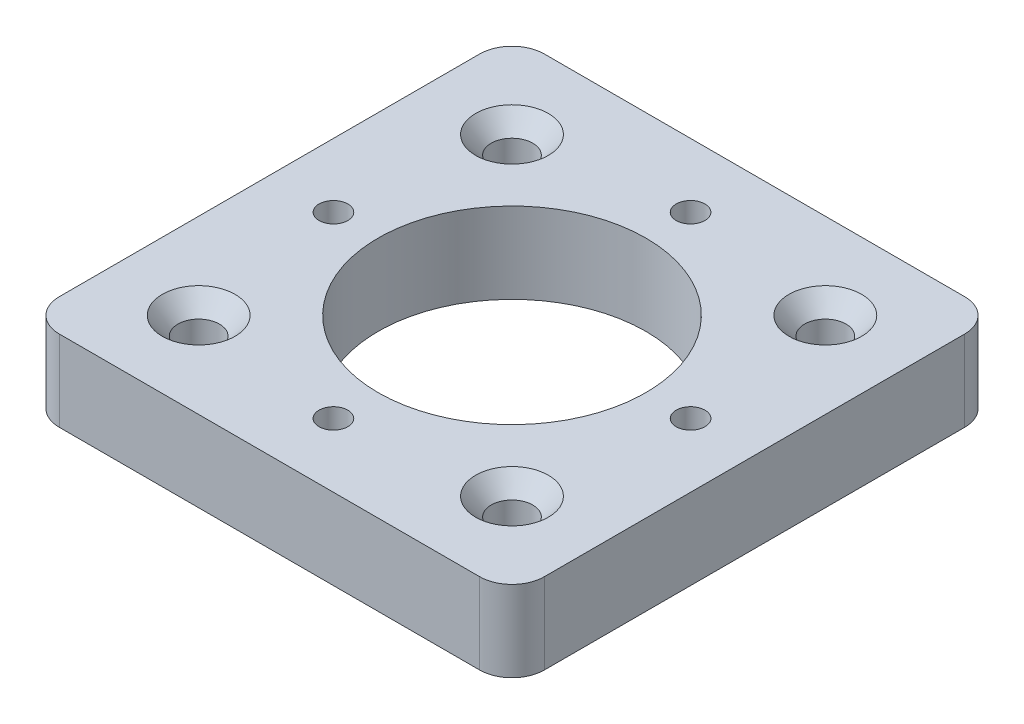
ISO-10303-21;
HEADER;
FILE_DESCRIPTION(('STEP AP214'),'2;1');
FILE_NAME('part.step','',(''),(''),'','','');
FILE_SCHEMA(('AUTOMOTIVE_DESIGN { 1 0 10303 214 1 1 1 1 }'));
ENDSEC;
DATA;
#1=APPLICATION_CONTEXT('core data for automotive mechanical design processes');
#2=APPLICATION_PROTOCOL_DEFINITION('international standard','automotive_design',2000,#1);
#3=PRODUCT_CONTEXT('',#1,'mechanical');
#4=PRODUCT('Part','Part','',(#3));
#5=PRODUCT_RELATED_PRODUCT_CATEGORY('part','',(#4));
#6=PRODUCT_DEFINITION_FORMATION('','',#4);
#7=PRODUCT_DEFINITION_CONTEXT('part definition',#1,'design');
#8=PRODUCT_DEFINITION('design','',#6,#7);
#9=PRODUCT_DEFINITION_SHAPE('','',#8);
#10=(LENGTH_UNIT() NAMED_UNIT(*) SI_UNIT(.MILLI.,.METRE.));
#11=(NAMED_UNIT(*) PLANE_ANGLE_UNIT() SI_UNIT($,.RADIAN.));
#12=(NAMED_UNIT(*) SI_UNIT($,.STERADIAN.) SOLID_ANGLE_UNIT());
#13=UNCERTAINTY_MEASURE_WITH_UNIT(LENGTH_MEASURE(1.E-05),#10,'distance_accuracy_value','');
#14=(GEOMETRIC_REPRESENTATION_CONTEXT(3) GLOBAL_UNCERTAINTY_ASSIGNED_CONTEXT((#13)) GLOBAL_UNIT_ASSIGNED_CONTEXT((#10,
#11,#12)) REPRESENTATION_CONTEXT('',''));
#15=CARTESIAN_POINT('',(0.,0.,0.));
#16=DIRECTION('',(0.,0.,1.));
#17=DIRECTION('',(1.,0.,0.));
#18=AXIS2_PLACEMENT_3D('',#15,#16,#17);
#19=CARTESIAN_POINT('',(19.05,6.35,-19.05));
#20=DIRECTION('',(-1.,0.,0.));
#21=DIRECTION('',(0.,0.,1.));
#22=AXIS2_PLACEMENT_3D('',#19,#20,#21);
#23=PLANE('',#22);
#24=DIRECTION('',(0.,0.,-1.));
#25=VECTOR('',#24,1.);
#26=CARTESIAN_POINT('',(19.05,6.35,-19.05));
#27=LINE('',#26,#25);
#28=CARTESIAN_POINT('',(19.05,6.35,16.51));
#29=VERTEX_POINT('',#28);
#30=CARTESIAN_POINT('',(19.05,6.35,-16.51));
#31=VERTEX_POINT('',#30);
#32=EDGE_CURVE('E129',#29,#31,#27,.T.);
#33=ORIENTED_EDGE('',*,*,#32,.F.);
#34=DIRECTION('',(0.,-1.,0.));
#35=VECTOR('',#34,1.);
#36=CARTESIAN_POINT('',(19.05,6.35,16.51));
#37=LINE('',#36,#35);
#38=CARTESIAN_POINT('',(19.05,0.,16.51));
#39=VERTEX_POINT('',#38);
#40=EDGE_CURVE('E155',#29,#39,#37,.T.);
#41=ORIENTED_EDGE('',*,*,#40,.T.);
#42=DIRECTION('',(0.,0.,-1.));
#43=VECTOR('',#42,1.);
#44=CARTESIAN_POINT('',(19.05,0.,-19.05));
#45=LINE('',#44,#43);
#46=CARTESIAN_POINT('',(19.05,0.,-16.51));
#47=VERTEX_POINT('',#46);
#48=EDGE_CURVE('E161',#39,#47,#45,.T.);
#49=ORIENTED_EDGE('',*,*,#48,.T.);
#50=DIRECTION('',(0.,-1.,0.));
#51=VECTOR('',#50,1.);
#52=CARTESIAN_POINT('',(19.05,6.35,-16.51));
#53=LINE('',#52,#51);
#54=EDGE_CURVE('E153',#47,#31,#53,.F.);
#55=ORIENTED_EDGE('',*,*,#54,.T.);
#56=EDGE_LOOP('',(#33,#41,#49,#55));
#57=FACE_BOUND('',#56,.T.);
#58=ADVANCED_FACE('F37',(#57),#23,.F.);
#59=CARTESIAN_POINT('',(-19.05,6.35,-19.05));
#60=DIRECTION('',(0.,0.,1.));
#61=DIRECTION('',(1.,0.,0.));
#62=AXIS2_PLACEMENT_3D('',#59,#60,#61);
#63=PLANE('',#62);
#64=DIRECTION('',(-1.,0.,0.));
#65=VECTOR('',#64,1.);
#66=CARTESIAN_POINT('',(-19.05,6.35,-19.05));
#67=LINE('',#66,#65);
#68=CARTESIAN_POINT('',(16.51,6.35,-19.05));
#69=VERTEX_POINT('',#68);
#70=CARTESIAN_POINT('',(-16.51,6.35,-19.05));
#71=VERTEX_POINT('',#70);
#72=EDGE_CURVE('E132',#69,#71,#67,.T.);
#73=ORIENTED_EDGE('',*,*,#72,.F.);
#74=DIRECTION('',(0.,-1.,0.));
#75=VECTOR('',#74,1.);
#76=CARTESIAN_POINT('',(16.51,6.35,-19.05));
#77=LINE('',#76,#75);
#78=CARTESIAN_POINT('',(16.51,0.,-19.05));
#79=VERTEX_POINT('',#78);
#80=EDGE_CURVE('E11',#69,#79,#77,.T.);
#81=ORIENTED_EDGE('',*,*,#80,.T.);
#82=DIRECTION('',(-1.,0.,0.));
#83=VECTOR('',#82,1.);
#84=CARTESIAN_POINT('',(-19.05,0.,-19.05));
#85=LINE('',#84,#83);
#86=CARTESIAN_POINT('',(-16.51,0.,-19.05));
#87=VERTEX_POINT('',#86);
#88=EDGE_CURVE('E134',#79,#87,#85,.T.);
#89=ORIENTED_EDGE('',*,*,#88,.T.);
#90=DIRECTION('',(0.,-1.,0.));
#91=VECTOR('',#90,1.);
#92=CARTESIAN_POINT('',(-16.51,6.35,-19.05));
#93=LINE('',#92,#91);
#94=EDGE_CURVE('E45',#87,#71,#93,.F.);
#95=ORIENTED_EDGE('',*,*,#94,.T.);
#96=EDGE_LOOP('',(#73,#81,#89,#95));
#97=FACE_BOUND('',#96,.T.);
#98=ADVANCED_FACE('F267',(#97),#63,.F.);
#99=CARTESIAN_POINT('',(-19.05,6.35,-19.05));
#100=DIRECTION('',(1.,0.,0.));
#101=DIRECTION('',(0.,0.,-1.));
#102=AXIS2_PLACEMENT_3D('',#99,#100,#101);
#103=PLANE('',#102);
#104=DIRECTION('',(0.,0.,1.));
#105=VECTOR('',#104,1.);
#106=CARTESIAN_POINT('',(-19.05,0.,-19.05));
#107=LINE('',#106,#105);
#108=CARTESIAN_POINT('',(-19.05,0.,-16.51));
#109=VERTEX_POINT('',#108);
#110=CARTESIAN_POINT('',(-19.05,0.,16.51));
#111=VERTEX_POINT('',#110);
#112=EDGE_CURVE('E130',#109,#111,#107,.T.);
#113=ORIENTED_EDGE('',*,*,#112,.T.);
#114=DIRECTION('',(0.,-1.,0.));
#115=VECTOR('',#114,1.);
#116=CARTESIAN_POINT('',(-19.05,6.35,16.51));
#117=LINE('',#116,#115);
#118=CARTESIAN_POINT('',(-19.05,6.35,16.51));
#119=VERTEX_POINT('',#118);
#120=EDGE_CURVE('E108',#111,#119,#117,.F.);
#121=ORIENTED_EDGE('',*,*,#120,.T.);
#122=DIRECTION('',(0.,0.,1.));
#123=VECTOR('',#122,1.);
#124=CARTESIAN_POINT('',(-19.05,6.35,-19.05));
#125=LINE('',#124,#123);
#126=CARTESIAN_POINT('',(-19.05,6.35,-16.51));
#127=VERTEX_POINT('',#126);
#128=EDGE_CURVE('E173',#127,#119,#125,.T.);
#129=ORIENTED_EDGE('',*,*,#128,.F.);
#130=DIRECTION('',(0.,-1.,0.));
#131=VECTOR('',#130,1.);
#132=CARTESIAN_POINT('',(-19.05,6.35,-16.51));
#133=LINE('',#132,#131);
#134=EDGE_CURVE('E113',#127,#109,#133,.T.);
#135=ORIENTED_EDGE('',*,*,#134,.T.);
#136=EDGE_LOOP('',(#113,#121,#129,#135));
#137=FACE_BOUND('',#136,.T.);
#138=ADVANCED_FACE('F265',(#137),#103,.F.);
#139=CARTESIAN_POINT('',(-19.05,6.35,19.05));
#140=DIRECTION('',(0.,0.,-1.));
#141=DIRECTION('',(-1.,0.,0.));
#142=AXIS2_PLACEMENT_3D('',#139,#140,#141);
#143=PLANE('',#142);
#144=DIRECTION('',(1.,0.,0.));
#145=VECTOR('',#144,1.);
#146=CARTESIAN_POINT('',(-19.05,6.35,19.05));
#147=LINE('',#146,#145);
#148=CARTESIAN_POINT('',(-16.51,6.35,19.05));
#149=VERTEX_POINT('',#148);
#150=CARTESIAN_POINT('',(16.51,6.35,19.05));
#151=VERTEX_POINT('',#150);
#152=EDGE_CURVE('E123',#149,#151,#147,.T.);
#153=ORIENTED_EDGE('',*,*,#152,.F.);
#154=DIRECTION('',(0.,-1.,0.));
#155=VECTOR('',#154,1.);
#156=CARTESIAN_POINT('',(-16.51,6.35,19.05));
#157=LINE('',#156,#155);
#158=CARTESIAN_POINT('',(-16.51,0.,19.05));
#159=VERTEX_POINT('',#158);
#160=EDGE_CURVE('E107',#149,#159,#157,.T.);
#161=ORIENTED_EDGE('',*,*,#160,.T.);
#162=DIRECTION('',(1.,0.,0.));
#163=VECTOR('',#162,1.);
#164=CARTESIAN_POINT('',(-19.05,0.,19.05));
#165=LINE('',#164,#163);
#166=CARTESIAN_POINT('',(16.51,0.,19.05));
#167=VERTEX_POINT('',#166);
#168=EDGE_CURVE('E120',#159,#167,#165,.T.);
#169=ORIENTED_EDGE('',*,*,#168,.T.);
#170=DIRECTION('',(0.,-1.,0.));
#171=VECTOR('',#170,1.);
#172=CARTESIAN_POINT('',(16.51,6.35,19.05));
#173=LINE('',#172,#171);
#174=EDGE_CURVE('E125',#167,#151,#173,.F.);
#175=ORIENTED_EDGE('',*,*,#174,.T.);
#176=EDGE_LOOP('',(#153,#161,#169,#175));
#177=FACE_BOUND('',#176,.T.);
#178=ADVANCED_FACE('F119',(#177),#143,.F.);
#179=CARTESIAN_POINT('',(0.,6.35,0.));
#180=DIRECTION('',(0.,1.,0.));
#181=DIRECTION('',(0.,0.,1.));
#182=AXIS2_PLACEMENT_3D('',#179,#180,#181);
#183=PLANE('',#182);
#184=CARTESIAN_POINT('',(5.20417042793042E-13,6.35,-14.0271600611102));
#185=DIRECTION('',(0.,1.,0.));
#186=DIRECTION('',(0.,0.,1.));
#187=AXIS2_PLACEMENT_3D('',#184,#185,#186);
#188=CIRCLE('',#187,1.1303);
#189=CARTESIAN_POINT('',(5.20417042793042E-13,6.35,-12.8968600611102));
#190=VERTEX_POINT('',#189);
#191=EDGE_CURVE('E236',#190,#190,#188,.T.);
#192=ORIENTED_EDGE('',*,*,#191,.F.);
#193=EDGE_LOOP('',(#192));
#194=FACE_BOUND('',#193,.T.);
#195=CARTESIAN_POINT('',(14.0271600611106,6.35,1.2629734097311E-13));
#196=DIRECTION('',(0.,1.,0.));
#197=DIRECTION('',(0.,0.,1.));
#198=AXIS2_PLACEMENT_3D('',#195,#196,#197);
#199=CIRCLE('',#198,1.1303);
#200=CARTESIAN_POINT('',(14.0271600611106,6.35,1.13030000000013));
#201=VERTEX_POINT('',#200);
#202=EDGE_CURVE('E230',#201,#201,#199,.T.);
#203=ORIENTED_EDGE('',*,*,#202,.F.);
#204=EDGE_LOOP('',(#203));
#205=FACE_BOUND('',#204,.T.);
#206=CARTESIAN_POINT('',(2.67822360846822E-13,6.35,14.0271600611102));
#207=DIRECTION('',(0.,1.,0.));
#208=DIRECTION('',(0.,0.,1.));
#209=AXIS2_PLACEMENT_3D('',#206,#207,#208);
#210=CIRCLE('',#209,1.1303);
#211=CARTESIAN_POINT('',(2.67822360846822E-13,6.35,15.1574600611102));
#212=VERTEX_POINT('',#211);
#213=EDGE_CURVE('E224',#212,#212,#210,.T.);
#214=ORIENTED_EDGE('',*,*,#213,.F.);
#215=EDGE_LOOP('',(#214));
#216=FACE_BOUND('',#215,.T.);
#217=CARTESIAN_POINT('',(-14.0271600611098,6.35,-1.28015172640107E-13));
#218=DIRECTION('',(0.,1.,0.));
#219=DIRECTION('',(0.,0.,1.));
#220=AXIS2_PLACEMENT_3D('',#217,#218,#219);
#221=CIRCLE('',#220,1.1303);
#222=CARTESIAN_POINT('',(-14.0271600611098,6.35,1.13029999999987));
#223=VERTEX_POINT('',#222);
#224=EDGE_CURVE('E218',#223,#223,#221,.T.);
#225=ORIENTED_EDGE('',*,*,#224,.F.);
#226=EDGE_LOOP('',(#225));
#227=FACE_BOUND('',#226,.T.);
#228=CARTESIAN_POINT('',(-12.3063,6.35,-12.3063));
#229=DIRECTION('',(0.,1.,0.));
#230=DIRECTION('',(0.,0.,1.));
#231=AXIS2_PLACEMENT_3D('',#228,#229,#230);
#232=CIRCLE('',#231,2.8575);
#233=CARTESIAN_POINT('',(-12.3063,6.35,-9.4488));
#234=VERTEX_POINT('',#233);
#235=EDGE_CURVE('E212',#234,#234,#232,.T.);
#236=ORIENTED_EDGE('',*,*,#235,.F.);
#237=EDGE_LOOP('',(#236));
#238=FACE_BOUND('',#237,.T.);
#239=CARTESIAN_POINT('',(12.3063,6.35,-12.3063000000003));
#240=DIRECTION('',(0.,1.,0.));
#241=DIRECTION('',(0.,0.,1.));
#242=AXIS2_PLACEMENT_3D('',#239,#240,#241);
#243=CIRCLE('',#242,2.8575);
#244=CARTESIAN_POINT('',(12.3063,6.35,-9.44880000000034));
#245=VERTEX_POINT('',#244);
#246=EDGE_CURVE('E203',#245,#245,#243,.T.);
#247=ORIENTED_EDGE('',*,*,#246,.F.);
#248=EDGE_LOOP('',(#247));
#249=FACE_BOUND('',#248,.T.);
#250=CARTESIAN_POINT('',(12.3063000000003,6.35,12.3062999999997));
#251=DIRECTION('',(0.,1.,0.));
#252=DIRECTION('',(0.,0.,1.));
#253=AXIS2_PLACEMENT_3D('',#250,#251,#252);
#254=CIRCLE('',#253,2.8575);
#255=CARTESIAN_POINT('',(12.3063000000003,6.35,15.1637999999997));
#256=VERTEX_POINT('',#255);
#257=EDGE_CURVE('E194',#256,#256,#254,.T.);
#258=ORIENTED_EDGE('',*,*,#257,.F.);
#259=EDGE_LOOP('',(#258));
#260=FACE_BOUND('',#259,.T.);
#261=CARTESIAN_POINT('',(-12.3062999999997,6.35,12.3063));
#262=DIRECTION('',(0.,1.,0.));
#263=DIRECTION('',(0.,0.,1.));
#264=AXIS2_PLACEMENT_3D('',#261,#262,#263);
#265=CIRCLE('',#264,2.8575);
#266=CARTESIAN_POINT('',(-12.3062999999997,6.35,15.1638));
#267=VERTEX_POINT('',#266);
#268=EDGE_CURVE('E185',#267,#267,#265,.T.);
#269=ORIENTED_EDGE('',*,*,#268,.F.);
#270=EDGE_LOOP('',(#269));
#271=FACE_BOUND('',#270,.T.);
#272=CARTESIAN_POINT('',(0.,6.35,0.));
#273=DIRECTION('',(0.,1.,0.));
#274=DIRECTION('',(0.,0.,1.));
#275=AXIS2_PLACEMENT_3D('',#272,#273,#274);
#276=CIRCLE('',#275,10.51687);
#277=CARTESIAN_POINT('',(0.,6.35,10.51687));
#278=VERTEX_POINT('',#277);
#279=EDGE_CURVE('E169',#278,#278,#276,.T.);
#280=ORIENTED_EDGE('',*,*,#279,.F.);
#281=EDGE_LOOP('',(#280));
#282=FACE_BOUND('',#281,.T.);
#283=ORIENTED_EDGE('',*,*,#128,.T.);
#284=CARTESIAN_POINT('',(-16.51,6.35,16.51));
#285=DIRECTION('',(0.,1.,0.));
#286=DIRECTION('',(0.,0.,1.));
#287=AXIS2_PLACEMENT_3D('',#284,#285,#286);
#288=CIRCLE('',#287,2.54);
#289=EDGE_CURVE('E151',#119,#149,#288,.T.);
#290=ORIENTED_EDGE('',*,*,#289,.T.);
#291=ORIENTED_EDGE('',*,*,#152,.T.);
#292=CARTESIAN_POINT('',(16.51,6.35,16.51));
#293=DIRECTION('',(0.,1.,0.));
#294=DIRECTION('',(0.,0.,1.));
#295=AXIS2_PLACEMENT_3D('',#292,#293,#294);
#296=CIRCLE('',#295,2.54);
#297=EDGE_CURVE('E149',#151,#29,#296,.T.);
#298=ORIENTED_EDGE('',*,*,#297,.T.);
#299=ORIENTED_EDGE('',*,*,#32,.T.);
#300=CARTESIAN_POINT('',(16.51,6.35,-16.51));
#301=DIRECTION('',(0.,1.,0.));
#302=DIRECTION('',(0.,0.,1.));
#303=AXIS2_PLACEMENT_3D('',#300,#301,#302);
#304=CIRCLE('',#303,2.54);
#305=EDGE_CURVE('E58',#31,#69,#304,.T.);
#306=ORIENTED_EDGE('',*,*,#305,.T.);
#307=ORIENTED_EDGE('',*,*,#72,.T.);
#308=CARTESIAN_POINT('',(-16.51,6.35,-16.51));
#309=DIRECTION('',(0.,1.,0.));
#310=DIRECTION('',(0.,0.,1.));
#311=AXIS2_PLACEMENT_3D('',#308,#309,#310);
#312=CIRCLE('',#311,2.54);
#313=EDGE_CURVE('E146',#71,#127,#312,.T.);
#314=ORIENTED_EDGE('',*,*,#313,.T.);
#315=EDGE_LOOP('',(#283,#290,#291,#298,#299,#306,#307,#314));
#316=FACE_BOUND('',#315,.T.);
#317=ADVANCED_FACE('F242',(#194,#205,#216,#227,#238,#249,#260,#271,#282,#316),#183,.T.);
#318=CARTESIAN_POINT('',(0.,0.,0.));
#319=DIRECTION('',(0.,1.,0.));
#320=DIRECTION('',(0.,0.,1.));
#321=AXIS2_PLACEMENT_3D('',#318,#319,#320);
#322=PLANE('',#321);
#323=CARTESIAN_POINT('',(5.20417042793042E-13,0.,-14.0271600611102));
#324=DIRECTION('',(0.,1.,0.));
#325=DIRECTION('',(0.,0.,1.));
#326=AXIS2_PLACEMENT_3D('',#323,#324,#325);
#327=CIRCLE('',#326,1.1303);
#328=CARTESIAN_POINT('',(5.20417042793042E-13,0.,-12.8968600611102));
#329=VERTEX_POINT('',#328);
#330=EDGE_CURVE('E233',#329,#329,#327,.T.);
#331=ORIENTED_EDGE('',*,*,#330,.T.);
#332=EDGE_LOOP('',(#331));
#333=FACE_BOUND('',#332,.T.);
#334=CARTESIAN_POINT('',(14.0271600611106,0.,1.2629734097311E-13));
#335=DIRECTION('',(0.,1.,0.));
#336=DIRECTION('',(0.,0.,1.));
#337=AXIS2_PLACEMENT_3D('',#334,#335,#336);
#338=CIRCLE('',#337,1.1303);
#339=CARTESIAN_POINT('',(14.0271600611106,0.,1.13030000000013));
#340=VERTEX_POINT('',#339);
#341=EDGE_CURVE('E227',#340,#340,#338,.T.);
#342=ORIENTED_EDGE('',*,*,#341,.T.);
#343=EDGE_LOOP('',(#342));
#344=FACE_BOUND('',#343,.T.);
#345=CARTESIAN_POINT('',(2.67822360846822E-13,0.,14.0271600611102));
#346=DIRECTION('',(0.,1.,0.));
#347=DIRECTION('',(0.,0.,1.));
#348=AXIS2_PLACEMENT_3D('',#345,#346,#347);
#349=CIRCLE('',#348,1.1303);
#350=CARTESIAN_POINT('',(2.67822360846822E-13,0.,15.1574600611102));
#351=VERTEX_POINT('',#350);
#352=EDGE_CURVE('E221',#351,#351,#349,.T.);
#353=ORIENTED_EDGE('',*,*,#352,.T.);
#354=EDGE_LOOP('',(#353));
#355=FACE_BOUND('',#354,.T.);
#356=CARTESIAN_POINT('',(-14.0271600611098,0.,-1.28015172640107E-13));
#357=DIRECTION('',(0.,1.,0.));
#358=DIRECTION('',(0.,0.,1.));
#359=AXIS2_PLACEMENT_3D('',#356,#357,#358);
#360=CIRCLE('',#359,1.1303);
#361=CARTESIAN_POINT('',(-14.0271600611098,0.,1.13029999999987));
#362=VERTEX_POINT('',#361);
#363=EDGE_CURVE('E215',#362,#362,#360,.T.);
#364=ORIENTED_EDGE('',*,*,#363,.T.);
#365=EDGE_LOOP('',(#364));
#366=FACE_BOUND('',#365,.T.);
#367=CARTESIAN_POINT('',(-12.3063,0.,-12.3063));
#368=DIRECTION('',(0.,1.,0.));
#369=DIRECTION('',(0.,0.,1.));
#370=AXIS2_PLACEMENT_3D('',#367,#368,#369);
#371=CIRCLE('',#370,1.63194999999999);
#372=CARTESIAN_POINT('',(-12.3063,0.,-10.67435));
#373=VERTEX_POINT('',#372);
#374=EDGE_CURVE('E206',#373,#373,#371,.T.);
#375=ORIENTED_EDGE('',*,*,#374,.T.);
#376=EDGE_LOOP('',(#375));
#377=FACE_BOUND('',#376,.T.);
#378=CARTESIAN_POINT('',(12.3063,0.,-12.3063000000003));
#379=DIRECTION('',(0.,1.,0.));
#380=DIRECTION('',(0.,0.,1.));
#381=AXIS2_PLACEMENT_3D('',#378,#379,#380);
#382=CIRCLE('',#381,1.63194999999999);
#383=CARTESIAN_POINT('',(12.3063,0.,-10.6743500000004));
#384=VERTEX_POINT('',#383);
#385=EDGE_CURVE('E197',#384,#384,#382,.T.);
#386=ORIENTED_EDGE('',*,*,#385,.T.);
#387=EDGE_LOOP('',(#386));
#388=FACE_BOUND('',#387,.T.);
#389=CARTESIAN_POINT('',(12.3063000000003,0.,12.3062999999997));
#390=DIRECTION('',(0.,1.,0.));
#391=DIRECTION('',(0.,0.,1.));
#392=AXIS2_PLACEMENT_3D('',#389,#390,#391);
#393=CIRCLE('',#392,1.63194999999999);
#394=CARTESIAN_POINT('',(12.3063000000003,0.,13.9382499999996));
#395=VERTEX_POINT('',#394);
#396=EDGE_CURVE('E188',#395,#395,#393,.T.);
#397=ORIENTED_EDGE('',*,*,#396,.T.);
#398=EDGE_LOOP('',(#397));
#399=FACE_BOUND('',#398,.T.);
#400=CARTESIAN_POINT('',(-12.3062999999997,0.,12.3063));
#401=DIRECTION('',(0.,1.,0.));
#402=DIRECTION('',(0.,0.,1.));
#403=AXIS2_PLACEMENT_3D('',#400,#401,#402);
#404=CIRCLE('',#403,1.63194999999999);
#405=CARTESIAN_POINT('',(-12.3062999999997,0.,13.93825));
#406=VERTEX_POINT('',#405);
#407=EDGE_CURVE('E178',#406,#406,#404,.T.);
#408=ORIENTED_EDGE('',*,*,#407,.T.);
#409=EDGE_LOOP('',(#408));
#410=FACE_BOUND('',#409,.T.);
#411=CARTESIAN_POINT('',(0.,0.,0.));
#412=DIRECTION('',(0.,1.,0.));
#413=DIRECTION('',(0.,0.,1.));
#414=AXIS2_PLACEMENT_3D('',#411,#412,#413);
#415=CIRCLE('',#414,10.51687);
#416=CARTESIAN_POINT('',(0.,0.,10.51687));
#417=VERTEX_POINT('',#416);
#418=EDGE_CURVE('E166',#417,#417,#415,.T.);
#419=ORIENTED_EDGE('',*,*,#418,.T.);
#420=EDGE_LOOP('',(#419));
#421=FACE_BOUND('',#420,.T.);
#422=ORIENTED_EDGE('',*,*,#168,.F.);
#423=CARTESIAN_POINT('',(-16.51,0.,16.51));
#424=DIRECTION('',(0.,1.,0.));
#425=DIRECTION('',(0.,0.,1.));
#426=AXIS2_PLACEMENT_3D('',#423,#424,#425);
#427=CIRCLE('',#426,2.54);
#428=EDGE_CURVE('E103',#159,#111,#427,.F.);
#429=ORIENTED_EDGE('',*,*,#428,.T.);
#430=ORIENTED_EDGE('',*,*,#112,.F.);
#431=CARTESIAN_POINT('',(-16.51,0.,-16.51));
#432=DIRECTION('',(0.,1.,0.));
#433=DIRECTION('',(0.,0.,1.));
#434=AXIS2_PLACEMENT_3D('',#431,#432,#433);
#435=CIRCLE('',#434,2.54);
#436=EDGE_CURVE('E124',#109,#87,#435,.F.);
#437=ORIENTED_EDGE('',*,*,#436,.T.);
#438=ORIENTED_EDGE('',*,*,#88,.F.);
#439=CARTESIAN_POINT('',(16.51,0.,-16.51));
#440=DIRECTION('',(0.,1.,0.));
#441=DIRECTION('',(0.,0.,1.));
#442=AXIS2_PLACEMENT_3D('',#439,#440,#441);
#443=CIRCLE('',#442,2.54);
#444=EDGE_CURVE('E140',#79,#47,#443,.F.);
#445=ORIENTED_EDGE('',*,*,#444,.T.);
#446=ORIENTED_EDGE('',*,*,#48,.F.);
#447=CARTESIAN_POINT('',(16.51,0.,16.51));
#448=DIRECTION('',(0.,1.,0.));
#449=DIRECTION('',(0.,0.,1.));
#450=AXIS2_PLACEMENT_3D('',#447,#448,#449);
#451=CIRCLE('',#450,2.54);
#452=EDGE_CURVE('E114',#39,#167,#451,.F.);
#453=ORIENTED_EDGE('',*,*,#452,.T.);
#454=EDGE_LOOP('',(#422,#429,#430,#437,#438,#445,#446,#453));
#455=FACE_BOUND('',#454,.T.);
#456=ADVANCED_FACE('F127',(#333,#344,#355,#366,#377,#388,#399,#410,#421,#455),#322,.F.);
#457=CARTESIAN_POINT('',(0.,0.,0.));
#458=DIRECTION('',(0.,1.,0.));
#459=DIRECTION('',(0.,0.,1.));
#460=AXIS2_PLACEMENT_3D('',#457,#458,#459);
#461=CYLINDRICAL_SURFACE('',#460,10.51687);
#462=ORIENTED_EDGE('',*,*,#418,.F.);
#463=EDGE_LOOP('',(#462));
#464=FACE_BOUND('',#463,.T.);
#465=ORIENTED_EDGE('',*,*,#279,.T.);
#466=EDGE_LOOP('',(#465));
#467=FACE_BOUND('',#466,.T.);
#468=ADVANCED_FACE('F291',(#464,#467),#461,.F.);
#469=CARTESIAN_POINT('',(-12.3062999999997,6.35,12.3063));
#470=DIRECTION('',(0.,1.,0.));
#471=DIRECTION('',(0.,0.,1.));
#472=AXIS2_PLACEMENT_3D('',#469,#470,#471);
#473=CYLINDRICAL_SURFACE('',#472,1.63194999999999);
#474=ORIENTED_EDGE('',*,*,#407,.F.);
#475=EDGE_LOOP('',(#474));
#476=FACE_BOUND('',#475,.T.);
#477=CARTESIAN_POINT('',(-12.3062999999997,4.94016599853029,12.3063));
#478=DIRECTION('',(0.,1.,0.));
#479=DIRECTION('',(0.,0.,1.));
#480=AXIS2_PLACEMENT_3D('',#477,#478,#479);
#481=CIRCLE('',#480,1.63195);
#482=CARTESIAN_POINT('',(-12.3062999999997,4.94016599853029,13.93825));
#483=VERTEX_POINT('',#482);
#484=EDGE_CURVE('E182',#483,#483,#481,.T.);
#485=ORIENTED_EDGE('',*,*,#484,.T.);
#486=EDGE_LOOP('',(#485));
#487=FACE_BOUND('',#486,.T.);
#488=ADVANCED_FACE('F296',(#476,#487),#473,.F.);
#489=CARTESIAN_POINT('',(-12.3062999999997,6.35,12.3063));
#490=DIRECTION('',(0.,1.,0.));
#491=DIRECTION('',(0.,0.,1.));
#492=AXIS2_PLACEMENT_3D('',#489,#490,#491);
#493=CONICAL_SURFACE('',#492,2.8575,0.715584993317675);
#494=ORIENTED_EDGE('',*,*,#484,.F.);
#495=EDGE_LOOP('',(#494));
#496=FACE_BOUND('',#495,.T.);
#497=ORIENTED_EDGE('',*,*,#268,.T.);
#498=EDGE_LOOP('',(#497));
#499=FACE_BOUND('',#498,.T.);
#500=ADVANCED_FACE('F300',(#496,#499),#493,.F.);
#501=CARTESIAN_POINT('',(12.3063000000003,6.35,12.3062999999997));
#502=DIRECTION('',(0.,1.,0.));
#503=DIRECTION('',(0.,0.,1.));
#504=AXIS2_PLACEMENT_3D('',#501,#502,#503);
#505=CYLINDRICAL_SURFACE('',#504,1.63194999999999);
#506=ORIENTED_EDGE('',*,*,#396,.F.);
#507=EDGE_LOOP('',(#506));
#508=FACE_BOUND('',#507,.T.);
#509=CARTESIAN_POINT('',(12.3063000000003,4.94016599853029,12.3062999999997));
#510=DIRECTION('',(0.,1.,0.));
#511=DIRECTION('',(0.,0.,1.));
#512=AXIS2_PLACEMENT_3D('',#509,#510,#511);
#513=CIRCLE('',#512,1.63195);
#514=CARTESIAN_POINT('',(12.3063000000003,4.94016599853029,13.9382499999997));
#515=VERTEX_POINT('',#514);
#516=EDGE_CURVE('E191',#515,#515,#513,.T.);
#517=ORIENTED_EDGE('',*,*,#516,.T.);
#518=EDGE_LOOP('',(#517));
#519=FACE_BOUND('',#518,.T.);
#520=ADVANCED_FACE('F304',(#508,#519),#505,.F.);
#521=CARTESIAN_POINT('',(12.3063000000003,6.35,12.3062999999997));
#522=DIRECTION('',(0.,1.,0.));
#523=DIRECTION('',(0.,0.,1.));
#524=AXIS2_PLACEMENT_3D('',#521,#522,#523);
#525=CONICAL_SURFACE('',#524,2.8575,0.715584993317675);
#526=ORIENTED_EDGE('',*,*,#516,.F.);
#527=EDGE_LOOP('',(#526));
#528=FACE_BOUND('',#527,.T.);
#529=ORIENTED_EDGE('',*,*,#257,.T.);
#530=EDGE_LOOP('',(#529));
#531=FACE_BOUND('',#530,.T.);
#532=ADVANCED_FACE('F308',(#528,#531),#525,.F.);
#533=CARTESIAN_POINT('',(12.3063,6.35,-12.3063000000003));
#534=DIRECTION('',(0.,1.,0.));
#535=DIRECTION('',(0.,0.,1.));
#536=AXIS2_PLACEMENT_3D('',#533,#534,#535);
#537=CYLINDRICAL_SURFACE('',#536,1.63194999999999);
#538=ORIENTED_EDGE('',*,*,#385,.F.);
#539=EDGE_LOOP('',(#538));
#540=FACE_BOUND('',#539,.T.);
#541=CARTESIAN_POINT('',(12.3063,4.94016599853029,-12.3063000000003));
#542=DIRECTION('',(0.,1.,0.));
#543=DIRECTION('',(0.,0.,1.));
#544=AXIS2_PLACEMENT_3D('',#541,#542,#543);
#545=CIRCLE('',#544,1.63195);
#546=CARTESIAN_POINT('',(12.3063,4.94016599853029,-10.6743500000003));
#547=VERTEX_POINT('',#546);
#548=EDGE_CURVE('E200',#547,#547,#545,.T.);
#549=ORIENTED_EDGE('',*,*,#548,.T.);
#550=EDGE_LOOP('',(#549));
#551=FACE_BOUND('',#550,.T.);
#552=ADVANCED_FACE('F312',(#540,#551),#537,.F.);
#553=CARTESIAN_POINT('',(12.3063,6.35,-12.3063000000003));
#554=DIRECTION('',(0.,1.,0.));
#555=DIRECTION('',(0.,0.,1.));
#556=AXIS2_PLACEMENT_3D('',#553,#554,#555);
#557=CONICAL_SURFACE('',#556,2.8575,0.715584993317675);
#558=ORIENTED_EDGE('',*,*,#548,.F.);
#559=EDGE_LOOP('',(#558));
#560=FACE_BOUND('',#559,.T.);
#561=ORIENTED_EDGE('',*,*,#246,.T.);
#562=EDGE_LOOP('',(#561));
#563=FACE_BOUND('',#562,.T.);
#564=ADVANCED_FACE('F316',(#560,#563),#557,.F.);
#565=CARTESIAN_POINT('',(-12.3063,6.35,-12.3063));
#566=DIRECTION('',(0.,1.,0.));
#567=DIRECTION('',(0.,0.,1.));
#568=AXIS2_PLACEMENT_3D('',#565,#566,#567);
#569=CYLINDRICAL_SURFACE('',#568,1.63194999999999);
#570=ORIENTED_EDGE('',*,*,#374,.F.);
#571=EDGE_LOOP('',(#570));
#572=FACE_BOUND('',#571,.T.);
#573=CARTESIAN_POINT('',(-12.3063,4.94016599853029,-12.3063));
#574=DIRECTION('',(0.,1.,0.));
#575=DIRECTION('',(0.,0.,1.));
#576=AXIS2_PLACEMENT_3D('',#573,#574,#575);
#577=CIRCLE('',#576,1.63195);
#578=CARTESIAN_POINT('',(-12.3063,4.94016599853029,-10.67435));
#579=VERTEX_POINT('',#578);
#580=EDGE_CURVE('E209',#579,#579,#577,.T.);
#581=ORIENTED_EDGE('',*,*,#580,.T.);
#582=EDGE_LOOP('',(#581));
#583=FACE_BOUND('',#582,.T.);
#584=ADVANCED_FACE('F320',(#572,#583),#569,.F.);
#585=CARTESIAN_POINT('',(-12.3063,6.35,-12.3063));
#586=DIRECTION('',(0.,1.,0.));
#587=DIRECTION('',(0.,0.,1.));
#588=AXIS2_PLACEMENT_3D('',#585,#586,#587);
#589=CONICAL_SURFACE('',#588,2.8575,0.715584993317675);
#590=ORIENTED_EDGE('',*,*,#580,.F.);
#591=EDGE_LOOP('',(#590));
#592=FACE_BOUND('',#591,.T.);
#593=ORIENTED_EDGE('',*,*,#235,.T.);
#594=EDGE_LOOP('',(#593));
#595=FACE_BOUND('',#594,.T.);
#596=ADVANCED_FACE('F324',(#592,#595),#589,.F.);
#597=CARTESIAN_POINT('',(-14.0271600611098,6.35,-1.28015172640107E-13));
#598=DIRECTION('',(0.,1.,0.));
#599=DIRECTION('',(0.,0.,1.));
#600=AXIS2_PLACEMENT_3D('',#597,#598,#599);
#601=CYLINDRICAL_SURFACE('',#600,1.1303);
#602=ORIENTED_EDGE('',*,*,#363,.F.);
#603=EDGE_LOOP('',(#602));
#604=FACE_BOUND('',#603,.T.);
#605=ORIENTED_EDGE('',*,*,#224,.T.);
#606=EDGE_LOOP('',(#605));
#607=FACE_BOUND('',#606,.T.);
#608=ADVANCED_FACE('F328',(#604,#607),#601,.F.);
#609=CARTESIAN_POINT('',(2.67822360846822E-13,6.35,14.0271600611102));
#610=DIRECTION('',(0.,1.,0.));
#611=DIRECTION('',(0.,0.,1.));
#612=AXIS2_PLACEMENT_3D('',#609,#610,#611);
#613=CYLINDRICAL_SURFACE('',#612,1.1303);
#614=ORIENTED_EDGE('',*,*,#352,.F.);
#615=EDGE_LOOP('',(#614));
#616=FACE_BOUND('',#615,.T.);
#617=ORIENTED_EDGE('',*,*,#213,.T.);
#618=EDGE_LOOP('',(#617));
#619=FACE_BOUND('',#618,.T.);
#620=ADVANCED_FACE('F332',(#616,#619),#613,.F.);
#621=CARTESIAN_POINT('',(14.0271600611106,6.35,1.2629734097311E-13));
#622=DIRECTION('',(0.,1.,0.));
#623=DIRECTION('',(0.,0.,1.));
#624=AXIS2_PLACEMENT_3D('',#621,#622,#623);
#625=CYLINDRICAL_SURFACE('',#624,1.1303);
#626=ORIENTED_EDGE('',*,*,#341,.F.);
#627=EDGE_LOOP('',(#626));
#628=FACE_BOUND('',#627,.T.);
#629=ORIENTED_EDGE('',*,*,#202,.T.);
#630=EDGE_LOOP('',(#629));
#631=FACE_BOUND('',#630,.T.);
#632=ADVANCED_FACE('F336',(#628,#631),#625,.F.);
#633=CARTESIAN_POINT('',(5.20417042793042E-13,6.35,-14.0271600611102));
#634=DIRECTION('',(0.,1.,0.));
#635=DIRECTION('',(0.,0.,1.));
#636=AXIS2_PLACEMENT_3D('',#633,#634,#635);
#637=CYLINDRICAL_SURFACE('',#636,1.1303);
#638=ORIENTED_EDGE('',*,*,#330,.F.);
#639=EDGE_LOOP('',(#638));
#640=FACE_BOUND('',#639,.T.);
#641=ORIENTED_EDGE('',*,*,#191,.T.);
#642=EDGE_LOOP('',(#641));
#643=FACE_BOUND('',#642,.T.);
#644=ADVANCED_FACE('F240',(#640,#643),#637,.F.);
#645=CARTESIAN_POINT('',(-16.51,6.35,16.51));
#646=DIRECTION('',(0.,-1.,0.));
#647=DIRECTION('',(0.,0.,-1.));
#648=AXIS2_PLACEMENT_3D('',#645,#646,#647);
#649=CYLINDRICAL_SURFACE('',#648,2.54);
#650=ORIENTED_EDGE('',*,*,#289,.F.);
#651=ORIENTED_EDGE('',*,*,#120,.F.);
#652=ORIENTED_EDGE('',*,*,#428,.F.);
#653=ORIENTED_EDGE('',*,*,#160,.F.);
#654=EDGE_LOOP('',(#650,#651,#652,#653));
#655=FACE_BOUND('',#654,.T.);
#656=ADVANCED_FACE('F106',(#655),#649,.T.);
#657=CARTESIAN_POINT('',(16.51,6.35,16.51));
#658=DIRECTION('',(0.,-1.,0.));
#659=DIRECTION('',(0.,0.,-1.));
#660=AXIS2_PLACEMENT_3D('',#657,#658,#659);
#661=CYLINDRICAL_SURFACE('',#660,2.54);
#662=ORIENTED_EDGE('',*,*,#297,.F.);
#663=ORIENTED_EDGE('',*,*,#174,.F.);
#664=ORIENTED_EDGE('',*,*,#452,.F.);
#665=ORIENTED_EDGE('',*,*,#40,.F.);
#666=EDGE_LOOP('',(#662,#663,#664,#665));
#667=FACE_BOUND('',#666,.T.);
#668=ADVANCED_FACE('F271',(#667),#661,.T.);
#669=CARTESIAN_POINT('',(16.51,6.35,-16.51));
#670=DIRECTION('',(0.,-1.,0.));
#671=DIRECTION('',(0.,0.,-1.));
#672=AXIS2_PLACEMENT_3D('',#669,#670,#671);
#673=CYLINDRICAL_SURFACE('',#672,2.54);
#674=ORIENTED_EDGE('',*,*,#305,.F.);
#675=ORIENTED_EDGE('',*,*,#54,.F.);
#676=ORIENTED_EDGE('',*,*,#444,.F.);
#677=ORIENTED_EDGE('',*,*,#80,.F.);
#678=EDGE_LOOP('',(#674,#675,#676,#677));
#679=FACE_BOUND('',#678,.T.);
#680=ADVANCED_FACE('F270',(#679),#673,.T.);
#681=CARTESIAN_POINT('',(-16.51,6.35,-16.51));
#682=DIRECTION('',(0.,-1.,0.));
#683=DIRECTION('',(0.,0.,-1.));
#684=AXIS2_PLACEMENT_3D('',#681,#682,#683);
#685=CYLINDRICAL_SURFACE('',#684,2.54);
#686=ORIENTED_EDGE('',*,*,#313,.F.);
#687=ORIENTED_EDGE('',*,*,#94,.F.);
#688=ORIENTED_EDGE('',*,*,#436,.F.);
#689=ORIENTED_EDGE('',*,*,#134,.F.);
#690=EDGE_LOOP('',(#686,#687,#688,#689));
#691=FACE_BOUND('',#690,.T.);
#692=ADVANCED_FACE('F39',(#691),#685,.T.);
#693=CLOSED_SHELL('',(#58,#98,#138,#178,#317,#456,#468,#488,#500,#520,#532,#552,#564,#584,#596,
#608,#620,#632,#644,#656,#668,#680,#692));
#694=MANIFOLD_SOLID_BREP('B2',#693);
#695=ADVANCED_BREP_SHAPE_REPRESENTATION('',(#18,#694),#14);
#696=SHAPE_DEFINITION_REPRESENTATION(#9,#695);
ENDSEC;
END-ISO-10303-21;
